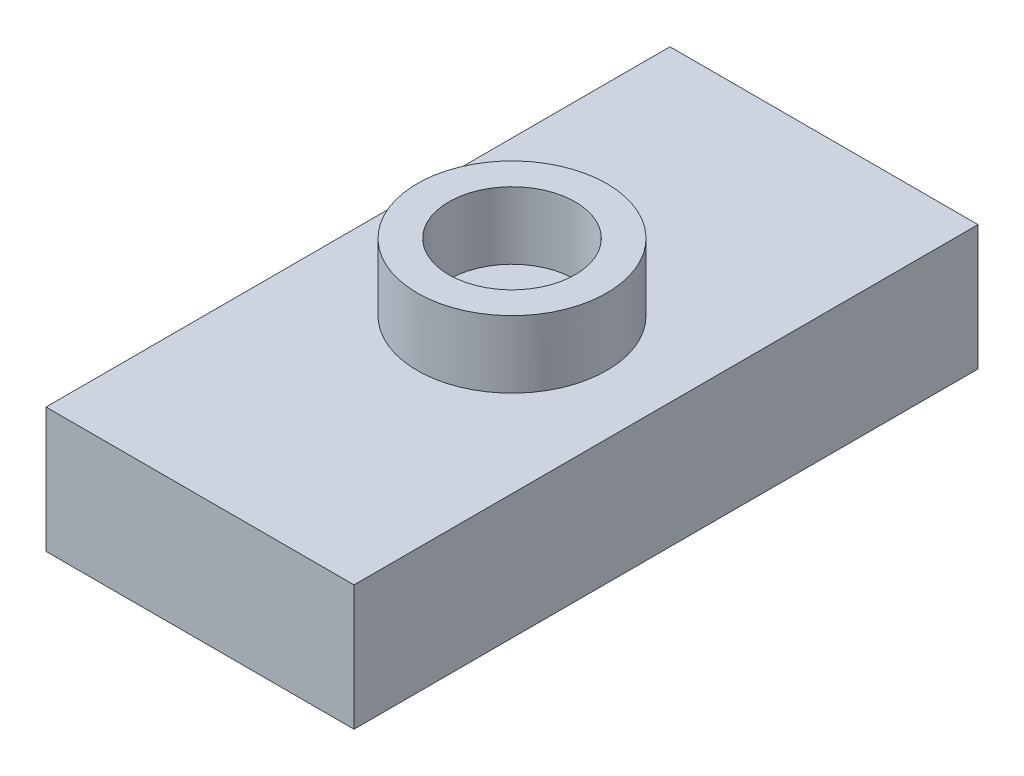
ISO-10303-21;
HEADER;
FILE_DESCRIPTION(('STEP AP214'),'2;1');
FILE_NAME('part.step','',(''),(''),'','','');
FILE_SCHEMA(('AUTOMOTIVE_DESIGN { 1 0 10303 214 1 1 1 1 }'));
ENDSEC;
DATA;
#1=APPLICATION_CONTEXT('core data for automotive mechanical design processes');
#2=APPLICATION_PROTOCOL_DEFINITION('international standard','automotive_design',2000,#1);
#3=PRODUCT_CONTEXT('',#1,'mechanical');
#4=PRODUCT('Part','Part','',(#3));
#5=PRODUCT_RELATED_PRODUCT_CATEGORY('part','',(#4));
#6=PRODUCT_DEFINITION_FORMATION('','',#4);
#7=PRODUCT_DEFINITION_CONTEXT('part definition',#1,'design');
#8=PRODUCT_DEFINITION('design','',#6,#7);
#9=PRODUCT_DEFINITION_SHAPE('','',#8);
#10=(LENGTH_UNIT() NAMED_UNIT(*) SI_UNIT(.MILLI.,.METRE.));
#11=(NAMED_UNIT(*) PLANE_ANGLE_UNIT() SI_UNIT($,.RADIAN.));
#12=(NAMED_UNIT(*) SI_UNIT($,.STERADIAN.) SOLID_ANGLE_UNIT());
#13=UNCERTAINTY_MEASURE_WITH_UNIT(LENGTH_MEASURE(1.E-05),#10,'distance_accuracy_value','');
#14=(GEOMETRIC_REPRESENTATION_CONTEXT(3) GLOBAL_UNCERTAINTY_ASSIGNED_CONTEXT((#13)) GLOBAL_UNIT_ASSIGNED_CONTEXT((#10,
#11,#12)) REPRESENTATION_CONTEXT('',''));
#15=CARTESIAN_POINT('',(0.,0.,0.));
#16=DIRECTION('',(0.,0.,1.));
#17=DIRECTION('',(1.,0.,0.));
#18=AXIS2_PLACEMENT_3D('',#15,#16,#17);
#19=CARTESIAN_POINT('',(0.,3.166,-15.8));
#20=DIRECTION('',(0.,-1.,0.));
#21=DIRECTION('',(0.,0.,-1.));
#22=AXIS2_PLACEMENT_3D('',#19,#20,#21);
#23=PLANE('',#22);
#24=DIRECTION('',(0.,0.,1.));
#25=VECTOR('',#24,1.);
#26=CARTESIAN_POINT('',(0.,3.166,0.));
#27=LINE('',#26,#25);
#28=CARTESIAN_POINT('',(0.,3.166,-15.8));
#29=VERTEX_POINT('',#28);
#30=CARTESIAN_POINT('',(0.,3.166,0.));
#31=VERTEX_POINT('',#30);
#32=EDGE_CURVE('E190',#29,#31,#27,.T.);
#33=ORIENTED_EDGE('',*,*,#32,.T.);
#34=DIRECTION('',(1.,0.,0.));
#35=VECTOR('',#34,1.);
#36=CARTESIAN_POINT('',(0.,3.166,0.));
#37=LINE('',#36,#35);
#38=CARTESIAN_POINT('',(7.8,3.166,0.));
#39=VERTEX_POINT('',#38);
#40=EDGE_CURVE('E193',#31,#39,#37,.T.);
#41=ORIENTED_EDGE('',*,*,#40,.T.);
#42=DIRECTION('',(0.,0.,-1.));
#43=VECTOR('',#42,1.);
#44=CARTESIAN_POINT('',(7.8,3.166,0.));
#45=LINE('',#44,#43);
#46=CARTESIAN_POINT('',(7.8,3.166,-15.8));
#47=VERTEX_POINT('',#46);
#48=EDGE_CURVE('E196',#39,#47,#45,.T.);
#49=ORIENTED_EDGE('',*,*,#48,.T.);
#50=DIRECTION('',(-1.,0.,0.));
#51=VECTOR('',#50,1.);
#52=CARTESIAN_POINT('',(0.,3.166,-15.8));
#53=LINE('',#52,#51);
#54=EDGE_CURVE('E198',#47,#29,#53,.T.);
#55=ORIENTED_EDGE('',*,*,#54,.T.);
#56=EDGE_LOOP('',(#33,#41,#49,#55));
#57=FACE_BOUND('',#56,.T.);
#58=CARTESIAN_POINT('',(3.9,3.166,-7.9));
#59=DIRECTION('',(0.,-1.,0.));
#60=DIRECTION('',(0.,0.,-1.));
#61=AXIS2_PLACEMENT_3D('',#58,#59,#60);
#62=CIRCLE('',#61,2.4);
#63=CARTESIAN_POINT('',(3.9,3.166,-10.3));
#64=VERTEX_POINT('',#63);
#65=EDGE_CURVE('E11',#64,#64,#62,.F.);
#66=ORIENTED_EDGE('',*,*,#65,.F.);
#67=EDGE_LOOP('',(#66));
#68=FACE_BOUND('',#67,.T.);
#69=ADVANCED_FACE('F35',(#57,#68),#23,.F.);
#70=CARTESIAN_POINT('',(0.,3.166,0.));
#71=DIRECTION('',(1.,0.,0.));
#72=DIRECTION('',(0.,0.,-1.));
#73=AXIS2_PLACEMENT_3D('',#70,#71,#72);
#74=PLANE('',#73);
#75=DIRECTION('',(0.,0.,1.));
#76=VECTOR('',#75,1.);
#77=CARTESIAN_POINT('',(0.,0.,0.));
#78=LINE('',#77,#76);
#79=CARTESIAN_POINT('',(0.,0.,-15.8));
#80=VERTEX_POINT('',#79);
#81=CARTESIAN_POINT('',(0.,0.,0.));
#82=VERTEX_POINT('',#81);
#83=EDGE_CURVE('E184',#80,#82,#78,.T.);
#84=ORIENTED_EDGE('',*,*,#83,.T.);
#85=DIRECTION('',(0.,-1.,0.));
#86=VECTOR('',#85,1.);
#87=CARTESIAN_POINT('',(0.,3.166,0.));
#88=LINE('',#87,#86);
#89=EDGE_CURVE('E43',#31,#82,#88,.T.);
#90=ORIENTED_EDGE('',*,*,#89,.F.);
#91=ORIENTED_EDGE('',*,*,#32,.F.);
#92=DIRECTION('',(0.,-1.,0.));
#93=VECTOR('',#92,1.);
#94=CARTESIAN_POINT('',(0.,3.166,-15.8));
#95=LINE('',#94,#93);
#96=EDGE_CURVE('E200',#29,#80,#95,.T.);
#97=ORIENTED_EDGE('',*,*,#96,.T.);
#98=EDGE_LOOP('',(#84,#90,#91,#97));
#99=FACE_BOUND('',#98,.T.);
#100=ADVANCED_FACE('F37',(#99),#74,.F.);
#101=CARTESIAN_POINT('',(0.,3.166,0.));
#102=DIRECTION('',(0.,0.,-1.));
#103=DIRECTION('',(-1.,0.,0.));
#104=AXIS2_PLACEMENT_3D('',#101,#102,#103);
#105=PLANE('',#104);
#106=DIRECTION('',(1.,0.,0.));
#107=VECTOR('',#106,1.);
#108=CARTESIAN_POINT('',(0.,0.,0.));
#109=LINE('',#108,#107);
#110=CARTESIAN_POINT('',(7.8,0.,0.));
#111=VERTEX_POINT('',#110);
#112=EDGE_CURVE('E203',#82,#111,#109,.T.);
#113=ORIENTED_EDGE('',*,*,#112,.T.);
#114=DIRECTION('',(0.,-1.,0.));
#115=VECTOR('',#114,1.);
#116=CARTESIAN_POINT('',(7.8,3.166,0.));
#117=LINE('',#116,#115);
#118=EDGE_CURVE('E213',#39,#111,#117,.T.);
#119=ORIENTED_EDGE('',*,*,#118,.F.);
#120=ORIENTED_EDGE('',*,*,#40,.F.);
#121=ORIENTED_EDGE('',*,*,#89,.T.);
#122=EDGE_LOOP('',(#113,#119,#120,#121));
#123=FACE_BOUND('',#122,.T.);
#124=ADVANCED_FACE('F218',(#123),#105,.F.);
#125=CARTESIAN_POINT('',(7.8,3.166,0.));
#126=DIRECTION('',(-1.,0.,0.));
#127=DIRECTION('',(0.,0.,1.));
#128=AXIS2_PLACEMENT_3D('',#125,#126,#127);
#129=PLANE('',#128);
#130=DIRECTION('',(0.,0.,-1.));
#131=VECTOR('',#130,1.);
#132=CARTESIAN_POINT('',(7.8,0.,0.));
#133=LINE('',#132,#131);
#134=CARTESIAN_POINT('',(7.8,0.,-15.8));
#135=VERTEX_POINT('',#134);
#136=EDGE_CURVE('E205',#111,#135,#133,.T.);
#137=ORIENTED_EDGE('',*,*,#136,.T.);
#138=DIRECTION('',(0.,-1.,0.));
#139=VECTOR('',#138,1.);
#140=CARTESIAN_POINT('',(7.8,3.166,-15.8));
#141=LINE('',#140,#139);
#142=EDGE_CURVE('E210',#47,#135,#141,.T.);
#143=ORIENTED_EDGE('',*,*,#142,.F.);
#144=ORIENTED_EDGE('',*,*,#48,.F.);
#145=ORIENTED_EDGE('',*,*,#118,.T.);
#146=EDGE_LOOP('',(#137,#143,#144,#145));
#147=FACE_BOUND('',#146,.T.);
#148=ADVANCED_FACE('F230',(#147),#129,.F.);
#149=CARTESIAN_POINT('',(0.,3.166,-15.8));
#150=DIRECTION('',(0.,0.,1.));
#151=DIRECTION('',(1.,0.,0.));
#152=AXIS2_PLACEMENT_3D('',#149,#150,#151);
#153=PLANE('',#152);
#154=DIRECTION('',(-1.,0.,0.));
#155=VECTOR('',#154,1.);
#156=CARTESIAN_POINT('',(0.,0.,-15.8));
#157=LINE('',#156,#155);
#158=EDGE_CURVE('E194',#135,#80,#157,.T.);
#159=ORIENTED_EDGE('',*,*,#158,.T.);
#160=ORIENTED_EDGE('',*,*,#96,.F.);
#161=ORIENTED_EDGE('',*,*,#54,.F.);
#162=ORIENTED_EDGE('',*,*,#142,.T.);
#163=EDGE_LOOP('',(#159,#160,#161,#162));
#164=FACE_BOUND('',#163,.T.);
#165=ADVANCED_FACE('F234',(#164),#153,.F.);
#166=CARTESIAN_POINT('',(0.,0.,-15.8));
#167=DIRECTION('',(0.,-1.,0.));
#168=DIRECTION('',(0.,0.,-1.));
#169=AXIS2_PLACEMENT_3D('',#166,#167,#168);
#170=PLANE('',#169);
#171=DIRECTION('',(0.,0.,-1.));
#172=VECTOR('',#171,1.);
#173=CARTESIAN_POINT('',(1.45,0.,-1.45));
#174=LINE('',#173,#172);
#175=CARTESIAN_POINT('',(1.45,0.,-1.45));
#176=VERTEX_POINT('',#175);
#177=CARTESIAN_POINT('',(1.45,0.,-6.35));
#178=VERTEX_POINT('',#177);
#179=EDGE_CURVE('E50',#176,#178,#174,.T.);
#180=ORIENTED_EDGE('',*,*,#179,.F.);
#181=DIRECTION('',(-1.,0.,0.));
#182=VECTOR('',#181,1.);
#183=CARTESIAN_POINT('',(1.45,0.,-1.45));
#184=LINE('',#183,#182);
#185=CARTESIAN_POINT('',(6.35,0.,-1.45));
#186=VERTEX_POINT('',#185);
#187=EDGE_CURVE('E154',#186,#176,#184,.T.);
#188=ORIENTED_EDGE('',*,*,#187,.F.);
#189=DIRECTION('',(0.,0.,1.));
#190=VECTOR('',#189,1.);
#191=CARTESIAN_POINT('',(6.35,0.,-1.45));
#192=LINE('',#191,#190);
#193=CARTESIAN_POINT('',(6.35,0.,-6.35));
#194=VERTEX_POINT('',#193);
#195=EDGE_CURVE('E145',#194,#186,#192,.T.);
#196=ORIENTED_EDGE('',*,*,#195,.F.);
#197=DIRECTION('',(1.,0.,0.));
#198=VECTOR('',#197,1.);
#199=CARTESIAN_POINT('',(1.45,0.,-6.35));
#200=LINE('',#199,#198);
#201=EDGE_CURVE('E133',#178,#194,#200,.T.);
#202=ORIENTED_EDGE('',*,*,#201,.F.);
#203=EDGE_LOOP('',(#180,#188,#196,#202));
#204=FACE_BOUND('',#203,.T.);
#205=DIRECTION('',(0.,0.,-1.));
#206=VECTOR('',#205,1.);
#207=CARTESIAN_POINT('',(1.45,0.,-9.45));
#208=LINE('',#207,#206);
#209=CARTESIAN_POINT('',(1.45,0.,-9.45));
#210=VERTEX_POINT('',#209);
#211=CARTESIAN_POINT('',(1.45,0.,-14.35));
#212=VERTEX_POINT('',#211);
#213=EDGE_CURVE('E58',#210,#212,#208,.T.);
#214=ORIENTED_EDGE('',*,*,#213,.F.);
#215=DIRECTION('',(-1.,0.,0.));
#216=VECTOR('',#215,1.);
#217=CARTESIAN_POINT('',(1.45,0.,-9.45));
#218=LINE('',#217,#216);
#219=CARTESIAN_POINT('',(6.35,0.,-9.45));
#220=VERTEX_POINT('',#219);
#221=EDGE_CURVE('E163',#220,#210,#218,.T.);
#222=ORIENTED_EDGE('',*,*,#221,.F.);
#223=DIRECTION('',(0.,0.,1.));
#224=VECTOR('',#223,1.);
#225=CARTESIAN_POINT('',(6.35,0.,-9.45));
#226=LINE('',#225,#224);
#227=CARTESIAN_POINT('',(6.35,0.,-14.35));
#228=VERTEX_POINT('',#227);
#229=EDGE_CURVE('E177',#228,#220,#226,.T.);
#230=ORIENTED_EDGE('',*,*,#229,.F.);
#231=DIRECTION('',(1.,0.,0.));
#232=VECTOR('',#231,1.);
#233=CARTESIAN_POINT('',(1.45,0.,-14.35));
#234=LINE('',#233,#232);
#235=EDGE_CURVE('E174',#212,#228,#234,.T.);
#236=ORIENTED_EDGE('',*,*,#235,.F.);
#237=EDGE_LOOP('',(#214,#222,#230,#236));
#238=FACE_BOUND('',#237,.T.);
#239=ORIENTED_EDGE('',*,*,#83,.F.);
#240=ORIENTED_EDGE('',*,*,#158,.F.);
#241=ORIENTED_EDGE('',*,*,#136,.F.);
#242=ORIENTED_EDGE('',*,*,#112,.F.);
#243=EDGE_LOOP('',(#239,#240,#241,#242));
#244=FACE_BOUND('',#243,.T.);
#245=ADVANCED_FACE('F226',(#204,#238,#244),#170,.T.);
#246=CARTESIAN_POINT('',(1.45,2.5,-9.45));
#247=DIRECTION('',(-1.,0.,0.));
#248=DIRECTION('',(0.,0.,1.));
#249=AXIS2_PLACEMENT_3D('',#246,#247,#248);
#250=PLANE('',#249);
#251=ORIENTED_EDGE('',*,*,#213,.T.);
#252=DIRECTION('',(0.,-1.,0.));
#253=VECTOR('',#252,1.);
#254=CARTESIAN_POINT('',(1.45,2.5,-14.35));
#255=LINE('',#254,#253);
#256=CARTESIAN_POINT('',(1.45,2.5,-14.35));
#257=VERTEX_POINT('',#256);
#258=EDGE_CURVE('E172',#257,#212,#255,.T.);
#259=ORIENTED_EDGE('',*,*,#258,.F.);
#260=DIRECTION('',(0.,0.,-1.));
#261=VECTOR('',#260,1.);
#262=CARTESIAN_POINT('',(1.45,2.5,-9.45));
#263=LINE('',#262,#261);
#264=CARTESIAN_POINT('',(1.45,2.5,-9.45));
#265=VERTEX_POINT('',#264);
#266=EDGE_CURVE('E159',#265,#257,#263,.T.);
#267=ORIENTED_EDGE('',*,*,#266,.F.);
#268=DIRECTION('',(0.,-1.,0.));
#269=VECTOR('',#268,1.);
#270=CARTESIAN_POINT('',(1.45,2.5,-9.45));
#271=LINE('',#270,#269);
#272=EDGE_CURVE('E182',#265,#210,#271,.T.);
#273=ORIENTED_EDGE('',*,*,#272,.T.);
#274=EDGE_LOOP('',(#251,#259,#267,#273));
#275=FACE_BOUND('',#274,.T.);
#276=ADVANCED_FACE('F281',(#275),#250,.F.);
#277=CARTESIAN_POINT('',(1.45,2.5,-9.45));
#278=DIRECTION('',(0.,0.,1.));
#279=DIRECTION('',(1.,0.,0.));
#280=AXIS2_PLACEMENT_3D('',#277,#278,#279);
#281=PLANE('',#280);
#282=ORIENTED_EDGE('',*,*,#221,.T.);
#283=ORIENTED_EDGE('',*,*,#272,.F.);
#284=DIRECTION('',(-1.,0.,0.));
#285=VECTOR('',#284,1.);
#286=CARTESIAN_POINT('',(1.45,2.5,-9.45));
#287=LINE('',#286,#285);
#288=CARTESIAN_POINT('',(6.35,2.5,-9.45));
#289=VERTEX_POINT('',#288);
#290=EDGE_CURVE('E169',#289,#265,#287,.T.);
#291=ORIENTED_EDGE('',*,*,#290,.F.);
#292=DIRECTION('',(0.,-1.,0.));
#293=VECTOR('',#292,1.);
#294=CARTESIAN_POINT('',(6.35,2.5,-9.45));
#295=LINE('',#294,#293);
#296=EDGE_CURVE('E185',#289,#220,#295,.T.);
#297=ORIENTED_EDGE('',*,*,#296,.T.);
#298=EDGE_LOOP('',(#282,#283,#291,#297));
#299=FACE_BOUND('',#298,.T.);
#300=ADVANCED_FACE('F277',(#299),#281,.F.);
#301=CARTESIAN_POINT('',(6.35,2.5,-9.45));
#302=DIRECTION('',(1.,0.,0.));
#303=DIRECTION('',(0.,0.,-1.));
#304=AXIS2_PLACEMENT_3D('',#301,#302,#303);
#305=PLANE('',#304);
#306=ORIENTED_EDGE('',*,*,#229,.T.);
#307=ORIENTED_EDGE('',*,*,#296,.F.);
#308=DIRECTION('',(0.,0.,1.));
#309=VECTOR('',#308,1.);
#310=CARTESIAN_POINT('',(6.35,2.5,-9.45));
#311=LINE('',#310,#309);
#312=CARTESIAN_POINT('',(6.35,2.5,-14.35));
#313=VERTEX_POINT('',#312);
#314=EDGE_CURVE('E166',#313,#289,#311,.T.);
#315=ORIENTED_EDGE('',*,*,#314,.F.);
#316=DIRECTION('',(0.,-1.,0.));
#317=VECTOR('',#316,1.);
#318=CARTESIAN_POINT('',(6.35,2.5,-14.35));
#319=LINE('',#318,#317);
#320=EDGE_CURVE('E187',#313,#228,#319,.T.);
#321=ORIENTED_EDGE('',*,*,#320,.T.);
#322=EDGE_LOOP('',(#306,#307,#315,#321));
#323=FACE_BOUND('',#322,.T.);
#324=ADVANCED_FACE('F280',(#323),#305,.F.);
#325=CARTESIAN_POINT('',(1.45,2.5,-14.35));
#326=DIRECTION('',(0.,0.,-1.));
#327=DIRECTION('',(-1.,0.,0.));
#328=AXIS2_PLACEMENT_3D('',#325,#326,#327);
#329=PLANE('',#328);
#330=ORIENTED_EDGE('',*,*,#235,.T.);
#331=ORIENTED_EDGE('',*,*,#320,.F.);
#332=DIRECTION('',(1.,0.,0.));
#333=VECTOR('',#332,1.);
#334=CARTESIAN_POINT('',(1.45,2.5,-14.35));
#335=LINE('',#334,#333);
#336=EDGE_CURVE('E162',#257,#313,#335,.T.);
#337=ORIENTED_EDGE('',*,*,#336,.F.);
#338=ORIENTED_EDGE('',*,*,#258,.T.);
#339=EDGE_LOOP('',(#330,#331,#337,#338));
#340=FACE_BOUND('',#339,.T.);
#341=ADVANCED_FACE('F275',(#340),#329,.F.);
#342=CARTESIAN_POINT('',(1.45,2.5,-14.35));
#343=DIRECTION('',(0.,-1.,0.));
#344=DIRECTION('',(0.,0.,-1.));
#345=AXIS2_PLACEMENT_3D('',#342,#343,#344);
#346=PLANE('',#345);
#347=ORIENTED_EDGE('',*,*,#266,.T.);
#348=ORIENTED_EDGE('',*,*,#336,.T.);
#349=ORIENTED_EDGE('',*,*,#314,.T.);
#350=ORIENTED_EDGE('',*,*,#290,.T.);
#351=EDGE_LOOP('',(#347,#348,#349,#350));
#352=FACE_BOUND('',#351,.T.);
#353=ADVANCED_FACE('F260',(#352),#346,.T.);
#354=CARTESIAN_POINT('',(1.45,2.5,-1.45));
#355=DIRECTION('',(-1.,0.,0.));
#356=DIRECTION('',(0.,0.,1.));
#357=AXIS2_PLACEMENT_3D('',#354,#355,#356);
#358=PLANE('',#357);
#359=ORIENTED_EDGE('',*,*,#179,.T.);
#360=DIRECTION('',(0.,-1.,0.));
#361=VECTOR('',#360,1.);
#362=CARTESIAN_POINT('',(1.45,2.5,-6.35));
#363=LINE('',#362,#361);
#364=CARTESIAN_POINT('',(1.45,2.5,-6.35));
#365=VERTEX_POINT('',#364);
#366=EDGE_CURVE('E138',#365,#178,#363,.T.);
#367=ORIENTED_EDGE('',*,*,#366,.F.);
#368=DIRECTION('',(0.,0.,-1.));
#369=VECTOR('',#368,1.);
#370=CARTESIAN_POINT('',(1.45,2.5,-1.45));
#371=LINE('',#370,#369);
#372=CARTESIAN_POINT('',(1.45,2.5,-1.45));
#373=VERTEX_POINT('',#372);
#374=EDGE_CURVE('E125',#373,#365,#371,.T.);
#375=ORIENTED_EDGE('',*,*,#374,.F.);
#376=DIRECTION('',(0.,-1.,0.));
#377=VECTOR('',#376,1.);
#378=CARTESIAN_POINT('',(1.45,2.5,-1.45));
#379=LINE('',#378,#377);
#380=EDGE_CURVE('E156',#373,#176,#379,.T.);
#381=ORIENTED_EDGE('',*,*,#380,.T.);
#382=EDGE_LOOP('',(#359,#367,#375,#381));
#383=FACE_BOUND('',#382,.T.);
#384=ADVANCED_FACE('F144',(#383),#358,.F.);
#385=CARTESIAN_POINT('',(1.45,2.5,-1.45));
#386=DIRECTION('',(0.,0.,1.));
#387=DIRECTION('',(1.,0.,0.));
#388=AXIS2_PLACEMENT_3D('',#385,#386,#387);
#389=PLANE('',#388);
#390=ORIENTED_EDGE('',*,*,#187,.T.);
#391=ORIENTED_EDGE('',*,*,#380,.F.);
#392=DIRECTION('',(-1.,0.,0.));
#393=VECTOR('',#392,1.);
#394=CARTESIAN_POINT('',(1.45,2.5,-1.45));
#395=LINE('',#394,#393);
#396=CARTESIAN_POINT('',(6.35,2.5,-1.45));
#397=VERTEX_POINT('',#396);
#398=EDGE_CURVE('E131',#397,#373,#395,.T.);
#399=ORIENTED_EDGE('',*,*,#398,.F.);
#400=DIRECTION('',(0.,-1.,0.));
#401=VECTOR('',#400,1.);
#402=CARTESIAN_POINT('',(6.35,2.5,-1.45));
#403=LINE('',#402,#401);
#404=EDGE_CURVE('E147',#397,#186,#403,.T.);
#405=ORIENTED_EDGE('',*,*,#404,.T.);
#406=EDGE_LOOP('',(#390,#391,#399,#405));
#407=FACE_BOUND('',#406,.T.);
#408=ADVANCED_FACE('F266',(#407),#389,.F.);
#409=CARTESIAN_POINT('',(6.35,2.5,-1.45));
#410=DIRECTION('',(1.,0.,0.));
#411=DIRECTION('',(0.,0.,-1.));
#412=AXIS2_PLACEMENT_3D('',#409,#410,#411);
#413=PLANE('',#412);
#414=ORIENTED_EDGE('',*,*,#195,.T.);
#415=ORIENTED_EDGE('',*,*,#404,.F.);
#416=DIRECTION('',(0.,0.,1.));
#417=VECTOR('',#416,1.);
#418=CARTESIAN_POINT('',(6.35,2.5,-1.45));
#419=LINE('',#418,#417);
#420=CARTESIAN_POINT('',(6.35,2.5,-6.35));
#421=VERTEX_POINT('',#420);
#422=EDGE_CURVE('E142',#421,#397,#419,.T.);
#423=ORIENTED_EDGE('',*,*,#422,.F.);
#424=DIRECTION('',(0.,-1.,0.));
#425=VECTOR('',#424,1.);
#426=CARTESIAN_POINT('',(6.35,2.5,-6.35));
#427=LINE('',#426,#425);
#428=EDGE_CURVE('E141',#421,#194,#427,.T.);
#429=ORIENTED_EDGE('',*,*,#428,.T.);
#430=EDGE_LOOP('',(#414,#415,#423,#429));
#431=FACE_BOUND('',#430,.T.);
#432=ADVANCED_FACE('F263',(#431),#413,.F.);
#433=CARTESIAN_POINT('',(1.45,2.5,-6.35));
#434=DIRECTION('',(0.,0.,-1.));
#435=DIRECTION('',(-1.,0.,0.));
#436=AXIS2_PLACEMENT_3D('',#433,#434,#435);
#437=PLANE('',#436);
#438=ORIENTED_EDGE('',*,*,#201,.T.);
#439=ORIENTED_EDGE('',*,*,#428,.F.);
#440=DIRECTION('',(1.,0.,0.));
#441=VECTOR('',#440,1.);
#442=CARTESIAN_POINT('',(1.45,2.5,-6.35));
#443=LINE('',#442,#441);
#444=EDGE_CURVE('E128',#365,#421,#443,.T.);
#445=ORIENTED_EDGE('',*,*,#444,.F.);
#446=ORIENTED_EDGE('',*,*,#366,.T.);
#447=EDGE_LOOP('',(#438,#439,#445,#446));
#448=FACE_BOUND('',#447,.T.);
#449=ADVANCED_FACE('F137',(#448),#437,.F.);
#450=CARTESIAN_POINT('',(1.45,2.5,-6.35));
#451=DIRECTION('',(0.,-1.,0.));
#452=DIRECTION('',(0.,0.,-1.));
#453=AXIS2_PLACEMENT_3D('',#450,#451,#452);
#454=PLANE('',#453);
#455=ORIENTED_EDGE('',*,*,#374,.T.);
#456=ORIENTED_EDGE('',*,*,#444,.T.);
#457=ORIENTED_EDGE('',*,*,#422,.T.);
#458=ORIENTED_EDGE('',*,*,#398,.T.);
#459=EDGE_LOOP('',(#455,#456,#457,#458));
#460=FACE_BOUND('',#459,.T.);
#461=ADVANCED_FACE('F127',(#460),#454,.T.);
#462=CARTESIAN_POINT('',(3.9,4.866,-7.9));
#463=DIRECTION('',(0.,1.,0.));
#464=DIRECTION('',(0.,0.,1.));
#465=AXIS2_PLACEMENT_3D('',#462,#463,#464);
#466=PLANE('',#465);
#467=CARTESIAN_POINT('',(3.9,4.866,-7.9));
#468=DIRECTION('',(0.,1.,0.));
#469=DIRECTION('',(0.,0.,1.));
#470=AXIS2_PLACEMENT_3D('',#467,#468,#469);
#471=CIRCLE('',#470,2.4);
#472=CARTESIAN_POINT('',(3.9,4.866,-5.5));
#473=VERTEX_POINT('',#472);
#474=EDGE_CURVE('E429',#473,#473,#471,.T.);
#475=ORIENTED_EDGE('',*,*,#474,.T.);
#476=EDGE_LOOP('',(#475));
#477=FACE_BOUND('',#476,.T.);
#478=CARTESIAN_POINT('',(3.9,4.866,-7.9));
#479=DIRECTION('',(0.,1.,0.));
#480=DIRECTION('',(0.,0.,1.));
#481=AXIS2_PLACEMENT_3D('',#478,#479,#480);
#482=CIRCLE('',#481,1.6);
#483=CARTESIAN_POINT('',(3.9,4.866,-6.3));
#484=VERTEX_POINT('',#483);
#485=EDGE_CURVE('E432',#484,#484,#482,.T.);
#486=ORIENTED_EDGE('',*,*,#485,.F.);
#487=EDGE_LOOP('',(#486));
#488=FACE_BOUND('',#487,.T.);
#489=ADVANCED_FACE('F245',(#477,#488),#466,.T.);
#490=CARTESIAN_POINT('',(3.9,4.866,-7.9));
#491=DIRECTION('',(0.,-1.,0.));
#492=DIRECTION('',(0.,0.,-1.));
#493=AXIS2_PLACEMENT_3D('',#490,#491,#492);
#494=CYLINDRICAL_SURFACE('',#493,2.4);
#495=ORIENTED_EDGE('',*,*,#474,.F.);
#496=EDGE_LOOP('',(#495));
#497=FACE_BOUND('',#496,.T.);
#498=ORIENTED_EDGE('',*,*,#65,.T.);
#499=EDGE_LOOP('',(#498));
#500=FACE_BOUND('',#499,.T.);
#501=ADVANCED_FACE('F242',(#497,#500),#494,.T.);
#502=CARTESIAN_POINT('',(3.9,4.866,-7.9));
#503=DIRECTION('',(0.,-1.,0.));
#504=DIRECTION('',(0.,0.,-1.));
#505=AXIS2_PLACEMENT_3D('',#502,#503,#504);
#506=CYLINDRICAL_SURFACE('',#505,1.6);
#507=ORIENTED_EDGE('',*,*,#485,.T.);
#508=EDGE_LOOP('',(#507));
#509=FACE_BOUND('',#508,.T.);
#510=CARTESIAN_POINT('',(3.9,3.166,-7.9));
#511=DIRECTION('',(0.,1.,0.));
#512=DIRECTION('',(0.,0.,1.));
#513=AXIS2_PLACEMENT_3D('',#510,#511,#512);
#514=CIRCLE('',#513,1.6);
#515=CARTESIAN_POINT('',(3.9,3.166,-6.3));
#516=VERTEX_POINT('',#515);
#517=EDGE_CURVE('E437',#516,#516,#514,.T.);
#518=ORIENTED_EDGE('',*,*,#517,.F.);
#519=EDGE_LOOP('',(#518));
#520=FACE_BOUND('',#519,.T.);
#521=ADVANCED_FACE('F244',(#509,#520),#506,.F.);
#522=ORIENTED_EDGE('',*,*,#517,.T.);
#523=EDGE_LOOP('',(#522));
#524=FACE_BOUND('',#523,.T.);
#525=ADVANCED_FACE('F239',(#524),#23,.F.);
#526=CLOSED_SHELL('',(#69,#100,#124,#148,#165,#245,#276,#300,#324,#341,#353,#384,#408,#432,#449,
#461,#489,#501,#521,#525));
#527=MANIFOLD_SOLID_BREP('B2',#526);
#528=ADVANCED_BREP_SHAPE_REPRESENTATION('',(#18,#527),#14);
#529=SHAPE_DEFINITION_REPRESENTATION(#9,#528);
ENDSEC;
END-ISO-10303-21;
